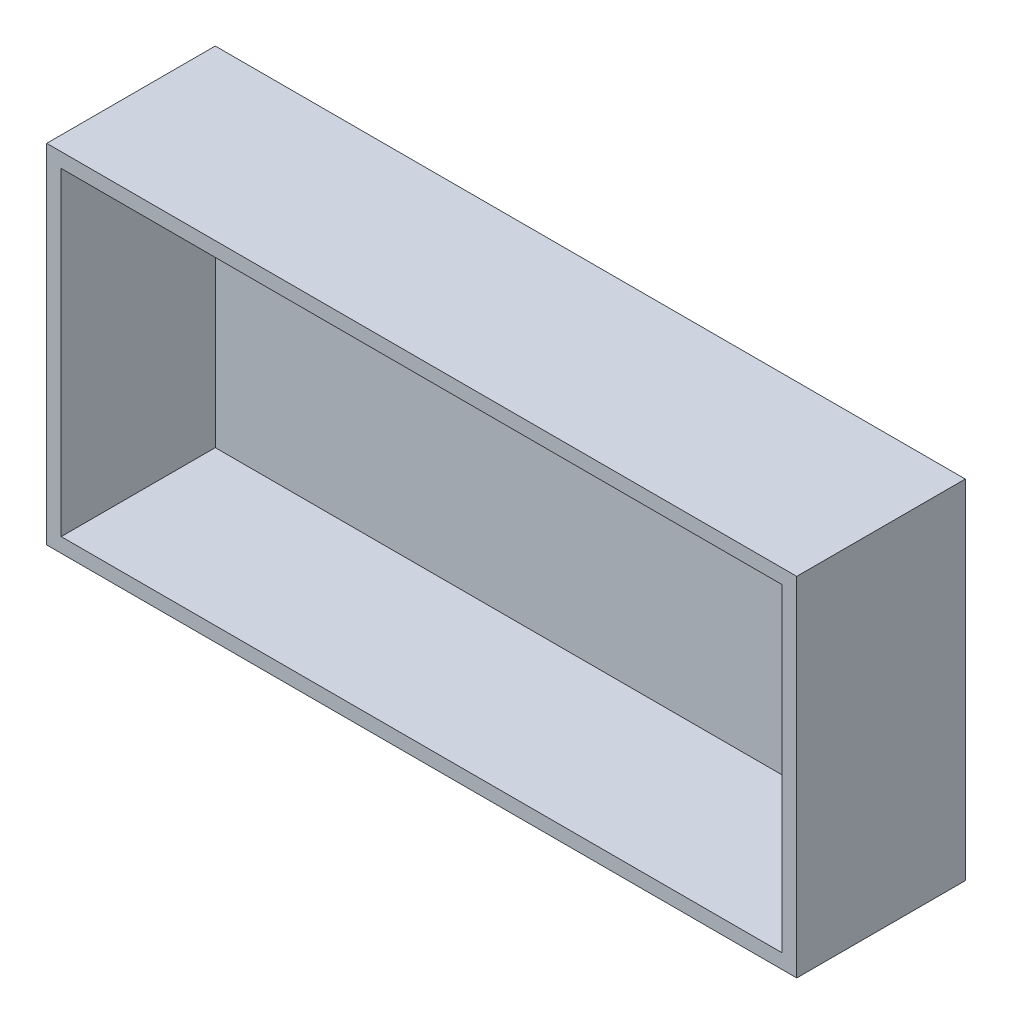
from build123d import *

# Parameters (mm, degrees)
SKETCH_1_W          = 51.75
SKETCH_1_H          = 24
EXTRUDE_1_DEPTH     = 11.63
SKETCH_2_W          = 49.75
SKETCH_2_H          = 22
CUT_EXTRUDE_1_DEPTH = 10.63


with BuildPart() as part:
    # Sketch 1 → Extrude 1 (new body)
    with BuildSketch(Plane.XY):
        Rectangle(SKETCH_1_W, SKETCH_1_H)
    extrude(amount=EXTRUDE_1_DEPTH)

    # Sketch 2 → Cut-Extrude 1 (cut)
    with BuildSketch(Plane.XY.offset(11.63)):
        Rectangle(SKETCH_2_W, SKETCH_2_H)
    extrude(amount=-CUT_EXTRUDE_1_DEPTH, mode=Mode.SUBTRACT)


solid = part.part
